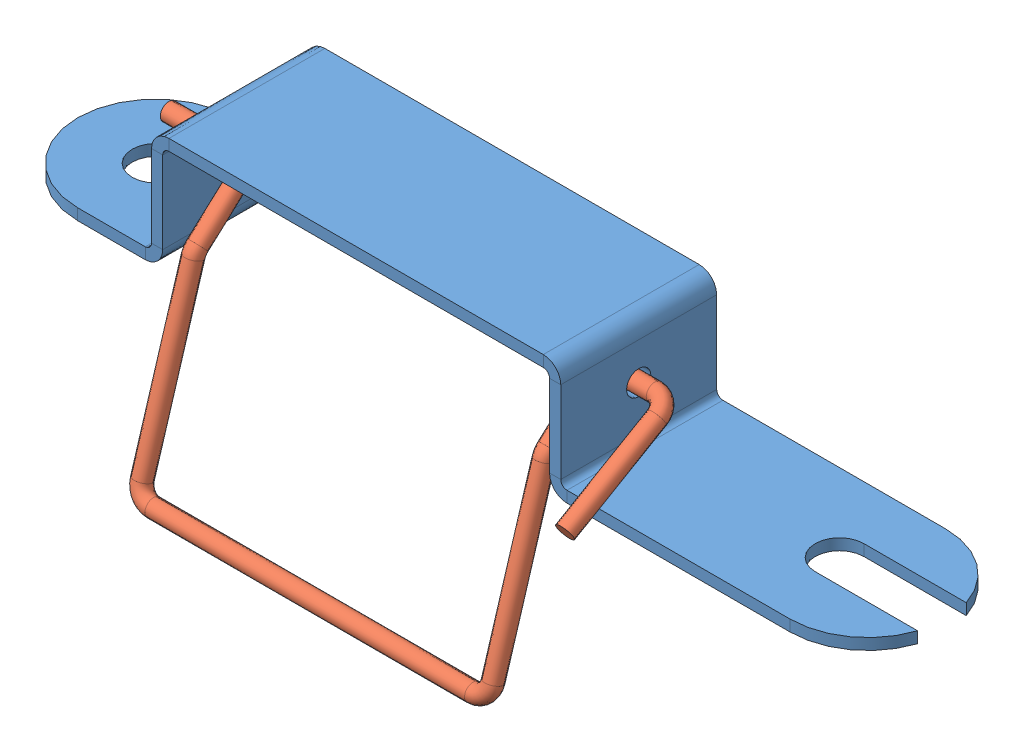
SolidWorks assembly Gate 1.SLDASM, configuration Default (file format 6000). Lengths in mm.
Overall size (70.41 25.6 19.67).
2 component instances, 2 part files, 2 mates.
Components (placement in the parent):
- Gate BKT 1-1: Gate BKT 1.SLDPRT [Default] at origin size (70.41 9.52 12.7)
- Gate Wire 1-1: Gate Wire 1.SLDPRT [Default] at (7.6981 -15.1899 9.2137) x (-1 0 0) z (0 0.290191 0.956969) size (41.55 22.59 7.97)
Mates (geometry in assembly coordinates):
- Concentric1: concentric aligned: cylinder of Gate BKT 1-1 through (63.9831 4.1656 0) axis (-1 0 0) radius 0.9906; cylinder of Gate Wire 1-1 through (6.4281 4.1656 0) axis (-1 0 0) radius 0.6985
- Distance1: distance = 4.9384 mm aligned: plane of Gate Wire 1-1 through (1.0052 4.1656 0) normal (-1 0 0); plane of Gate BKT 1-1 through (5.9436 0 6.35) normal (-1 0 0)
